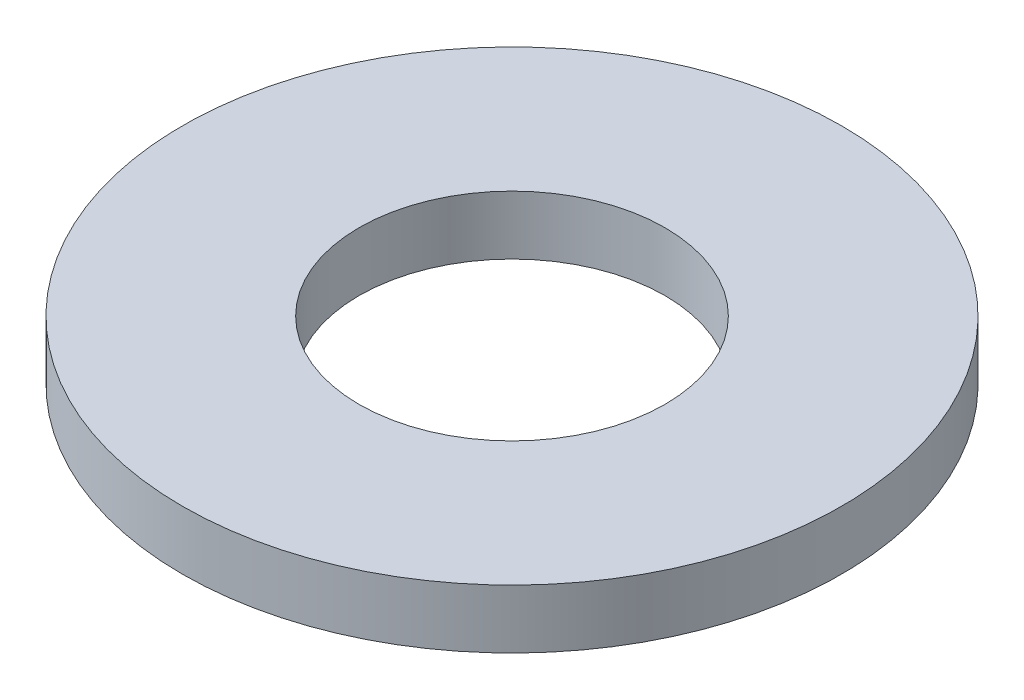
ISO-10303-21;
HEADER;
FILE_DESCRIPTION(('STEP AP214'),'2;1');
FILE_NAME('part.step','',(''),(''),'','','');
FILE_SCHEMA(('AUTOMOTIVE_DESIGN { 1 0 10303 214 1 1 1 1 }'));
ENDSEC;
DATA;
#1=APPLICATION_CONTEXT('core data for automotive mechanical design processes');
#2=APPLICATION_PROTOCOL_DEFINITION('international standard','automotive_design',2000,#1);
#3=PRODUCT_CONTEXT('',#1,'mechanical');
#4=PRODUCT('Part','Part','',(#3));
#5=PRODUCT_RELATED_PRODUCT_CATEGORY('part','',(#4));
#6=PRODUCT_DEFINITION_FORMATION('','',#4);
#7=PRODUCT_DEFINITION_CONTEXT('part definition',#1,'design');
#8=PRODUCT_DEFINITION('design','',#6,#7);
#9=PRODUCT_DEFINITION_SHAPE('','',#8);
#10=(LENGTH_UNIT() NAMED_UNIT(*) SI_UNIT(.MILLI.,.METRE.));
#11=(NAMED_UNIT(*) PLANE_ANGLE_UNIT() SI_UNIT($,.RADIAN.));
#12=(NAMED_UNIT(*) SI_UNIT($,.STERADIAN.) SOLID_ANGLE_UNIT());
#13=UNCERTAINTY_MEASURE_WITH_UNIT(LENGTH_MEASURE(1.E-05),#10,'distance_accuracy_value','');
#14=(GEOMETRIC_REPRESENTATION_CONTEXT(3) GLOBAL_UNCERTAINTY_ASSIGNED_CONTEXT((#13)) GLOBAL_UNIT_ASSIGNED_CONTEXT((#10,
#11,#12)) REPRESENTATION_CONTEXT('',''));
#15=CARTESIAN_POINT('',(0.,0.,0.));
#16=DIRECTION('',(0.,0.,1.));
#17=DIRECTION('',(1.,0.,0.));
#18=AXIS2_PLACEMENT_3D('',#15,#16,#17);
#19=CARTESIAN_POINT('',(0.,0.,0.));
#20=DIRECTION('',(0.,-1.,0.));
#21=DIRECTION('',(0.,0.,-1.));
#22=AXIS2_PLACEMENT_3D('',#19,#20,#21);
#23=CYLINDRICAL_SURFACE('',#22,3.25);
#24=CARTESIAN_POINT('',(0.,0.,0.));
#25=DIRECTION('',(0.,-1.,0.));
#26=DIRECTION('',(0.,0.,-1.));
#27=AXIS2_PLACEMENT_3D('',#24,#25,#26);
#28=CIRCLE('',#27,3.25);
#29=CARTESIAN_POINT('',(0.,0.,-3.25));
#30=VERTEX_POINT('',#29);
#31=EDGE_CURVE('E42',#30,#30,#28,.T.);
#32=ORIENTED_EDGE('',*,*,#31,.T.);
#33=EDGE_LOOP('',(#32));
#34=FACE_BOUND('',#33,.T.);
#35=CARTESIAN_POINT('',(0.,1.25,0.));
#36=DIRECTION('',(0.,-1.,0.));
#37=DIRECTION('',(0.,0.,-1.));
#38=AXIS2_PLACEMENT_3D('',#35,#36,#37);
#39=CIRCLE('',#38,3.25);
#40=CARTESIAN_POINT('',(0.,1.25,-3.25));
#41=VERTEX_POINT('',#40);
#42=EDGE_CURVE('E10',#41,#41,#39,.T.);
#43=ORIENTED_EDGE('',*,*,#42,.F.);
#44=EDGE_LOOP('',(#43));
#45=FACE_BOUND('',#44,.T.);
#46=ADVANCED_FACE('F28',(#34,#45),#23,.F.);
#47=CARTESIAN_POINT('',(3.25,1.25,0.));
#48=DIRECTION('',(0.,1.,0.));
#49=DIRECTION('',(0.,0.,1.));
#50=AXIS2_PLACEMENT_3D('',#47,#48,#49);
#51=PLANE('',#50);
#52=ORIENTED_EDGE('',*,*,#42,.T.);
#53=EDGE_LOOP('',(#52));
#54=FACE_BOUND('',#53,.T.);
#55=CARTESIAN_POINT('',(0.,1.25,0.));
#56=DIRECTION('',(0.,-1.,0.));
#57=DIRECTION('',(0.,0.,-1.));
#58=AXIS2_PLACEMENT_3D('',#55,#56,#57);
#59=CIRCLE('',#58,7.);
#60=CARTESIAN_POINT('',(0.,1.25,-7.));
#61=VERTEX_POINT('',#60);
#62=EDGE_CURVE('E34',#61,#61,#59,.T.);
#63=ORIENTED_EDGE('',*,*,#62,.F.);
#64=EDGE_LOOP('',(#63));
#65=FACE_BOUND('',#64,.T.);
#66=ADVANCED_FACE('F58',(#54,#65),#51,.T.);
#67=CARTESIAN_POINT('',(0.,0.,0.));
#68=DIRECTION('',(0.,-1.,0.));
#69=DIRECTION('',(0.,0.,-1.));
#70=AXIS2_PLACEMENT_3D('',#67,#68,#69);
#71=CYLINDRICAL_SURFACE('',#70,7.);
#72=ORIENTED_EDGE('',*,*,#62,.T.);
#73=EDGE_LOOP('',(#72));
#74=FACE_BOUND('',#73,.T.);
#75=CARTESIAN_POINT('',(0.,0.,0.));
#76=DIRECTION('',(0.,-1.,0.));
#77=DIRECTION('',(0.,0.,-1.));
#78=AXIS2_PLACEMENT_3D('',#75,#76,#77);
#79=CIRCLE('',#78,7.);
#80=CARTESIAN_POINT('',(0.,0.,-7.));
#81=VERTEX_POINT('',#80);
#82=EDGE_CURVE('E38',#81,#81,#79,.T.);
#83=ORIENTED_EDGE('',*,*,#82,.F.);
#84=EDGE_LOOP('',(#83));
#85=FACE_BOUND('',#84,.T.);
#86=ADVANCED_FACE('F52',(#74,#85),#71,.T.);
#87=CARTESIAN_POINT('',(3.25,0.,0.));
#88=DIRECTION('',(0.,-1.,0.));
#89=DIRECTION('',(0.,0.,-1.));
#90=AXIS2_PLACEMENT_3D('',#87,#88,#89);
#91=PLANE('',#90);
#92=ORIENTED_EDGE('',*,*,#82,.T.);
#93=EDGE_LOOP('',(#92));
#94=FACE_BOUND('',#93,.T.);
#95=ORIENTED_EDGE('',*,*,#31,.F.);
#96=EDGE_LOOP('',(#95));
#97=FACE_BOUND('',#96,.T.);
#98=ADVANCED_FACE('F50',(#94,#97),#91,.T.);
#99=CLOSED_SHELL('',(#46,#66,#86,#98));
#100=MANIFOLD_SOLID_BREP('B2',#99);
#101=ADVANCED_BREP_SHAPE_REPRESENTATION('',(#18,#100),#14);
#102=SHAPE_DEFINITION_REPRESENTATION(#9,#101);
ENDSEC;
END-ISO-10303-21;
